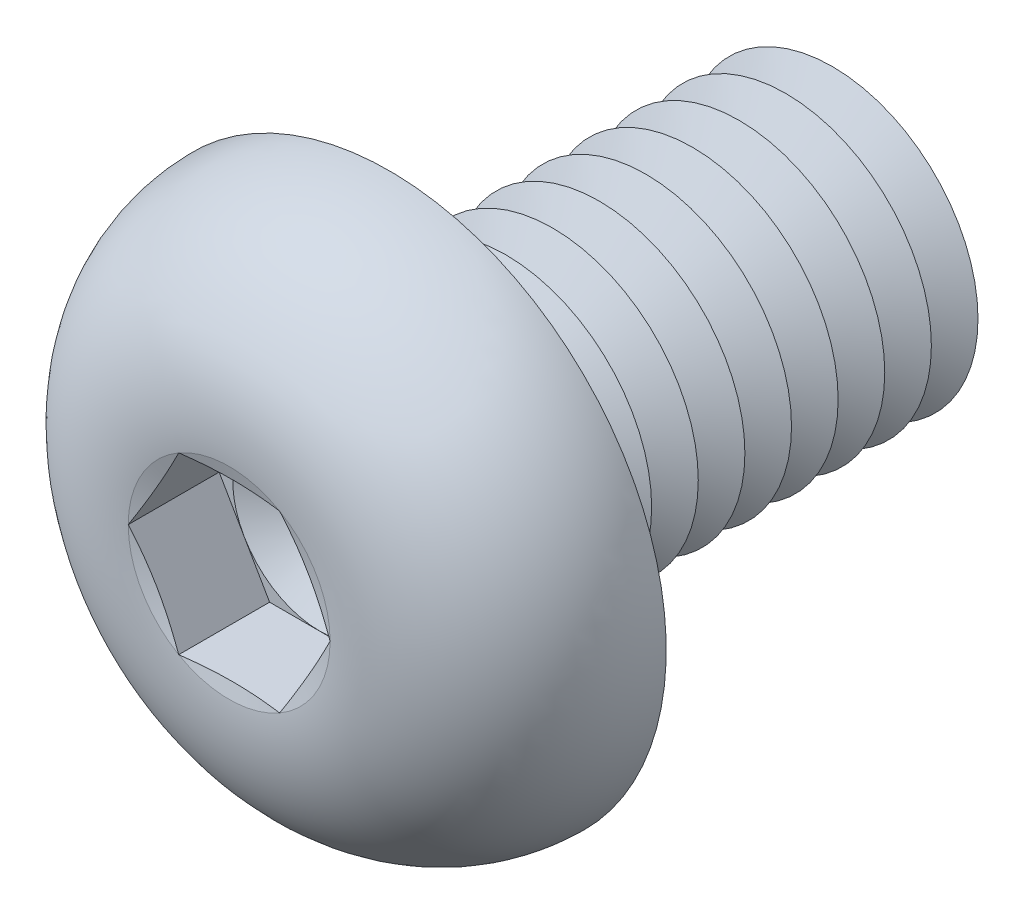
ISO-10303-21;
HEADER;
FILE_DESCRIPTION(('STEP AP214'),'2;1');
FILE_NAME('part.step','',(''),(''),'','','');
FILE_SCHEMA(('AUTOMOTIVE_DESIGN { 1 0 10303 214 1 1 1 1 }'));
ENDSEC;
DATA;
#1=APPLICATION_CONTEXT('core data for automotive mechanical design processes');
#2=APPLICATION_PROTOCOL_DEFINITION('international standard','automotive_design',2000,#1);
#3=PRODUCT_CONTEXT('',#1,'mechanical');
#4=PRODUCT('Part','Part','',(#3));
#5=PRODUCT_RELATED_PRODUCT_CATEGORY('part','',(#4));
#6=PRODUCT_DEFINITION_FORMATION('','',#4);
#7=PRODUCT_DEFINITION_CONTEXT('part definition',#1,'design');
#8=PRODUCT_DEFINITION('design','',#6,#7);
#9=PRODUCT_DEFINITION_SHAPE('','',#8);
#10=(LENGTH_UNIT() NAMED_UNIT(*) SI_UNIT(.MILLI.,.METRE.));
#11=(NAMED_UNIT(*) PLANE_ANGLE_UNIT() SI_UNIT($,.RADIAN.));
#12=(NAMED_UNIT(*) SI_UNIT($,.STERADIAN.) SOLID_ANGLE_UNIT());
#13=UNCERTAINTY_MEASURE_WITH_UNIT(LENGTH_MEASURE(1.E-05),#10,'distance_accuracy_value','');
#14=(GEOMETRIC_REPRESENTATION_CONTEXT(3) GLOBAL_UNCERTAINTY_ASSIGNED_CONTEXT((#13)) GLOBAL_UNIT_ASSIGNED_CONTEXT((#10,
#11,#12)) REPRESENTATION_CONTEXT('',''));
#15=CARTESIAN_POINT('',(0.,0.,0.));
#16=DIRECTION('',(0.,0.,1.));
#17=DIRECTION('',(1.,0.,0.));
#18=AXIS2_PLACEMENT_3D('',#15,#16,#17);
#19=CARTESIAN_POINT('',(0.,0.,1.19));
#20=DIRECTION('',(0.,0.,1.));
#21=DIRECTION('',(1.,0.,0.));
#22=AXIS2_PLACEMENT_3D('',#19,#20,#21);
#23=PLANE('',#22);
#24=CARTESIAN_POINT('',(0.,0.,1.19));
#25=DIRECTION('',(0.,0.,1.));
#26=DIRECTION('',(1.,0.,0.));
#27=AXIS2_PLACEMENT_3D('',#24,#25,#26);
#28=CIRCLE('',#27,1.49999930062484);
#29=CARTESIAN_POINT('',(1.2990375,0.749999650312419,1.19));
#30=VERTEX_POINT('',#29);
#31=CARTESIAN_POINT('',(0.,1.49999930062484,1.19));
#32=VERTEX_POINT('',#31);
#33=EDGE_CURVE('E118',#30,#32,#28,.T.);
#34=ORIENTED_EDGE('',*,*,#33,.F.);
#35=DIRECTION('',(-0.5,0.866025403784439,0.));
#36=VECTOR('',#35,1.);
#37=CARTESIAN_POINT('',(1.73205,0.,1.19));
#38=LINE('',#37,#36);
#39=CARTESIAN_POINT('',(0.866025,1.49999930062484,1.19));
#40=VERTEX_POINT('',#39);
#41=EDGE_CURVE('E125',#30,#40,#38,.T.);
#42=ORIENTED_EDGE('',*,*,#41,.T.);
#43=DIRECTION('',(-1.,0.,0.));
#44=VECTOR('',#43,1.);
#45=CARTESIAN_POINT('',(0.866025,1.49999930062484,1.19));
#46=LINE('',#45,#44);
#47=EDGE_CURVE('E136',#40,#32,#46,.T.);
#48=ORIENTED_EDGE('',*,*,#47,.T.);
#49=EDGE_LOOP('',(#34,#42,#48));
#50=FACE_BOUND('',#49,.T.);
#51=ADVANCED_FACE('F39',(#50),#23,.T.);
#52=CARTESIAN_POINT('',(0.,0.,1.19));
#53=DIRECTION('',(0.,0.,1.));
#54=DIRECTION('',(1.,0.,0.));
#55=AXIS2_PLACEMENT_3D('',#52,#53,#54);
#56=CIRCLE('',#55,1.49999930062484);
#57=CARTESIAN_POINT('',(-1.2990375,0.749999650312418,1.19));
#58=VERTEX_POINT('',#57);
#59=EDGE_CURVE('E11',#32,#58,#56,.T.);
#60=ORIENTED_EDGE('',*,*,#59,.F.);
#61=CARTESIAN_POINT('',(-0.866025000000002,1.49999930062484,1.19));
#62=VERTEX_POINT('',#61);
#63=EDGE_CURVE('E131',#32,#62,#46,.T.);
#64=ORIENTED_EDGE('',*,*,#63,.T.);
#65=DIRECTION('',(-0.5,-0.866025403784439,0.));
#66=VECTOR('',#65,1.);
#67=CARTESIAN_POINT('',(-0.866025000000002,1.49999930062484,1.19));
#68=LINE('',#67,#66);
#69=EDGE_CURVE('E134',#62,#58,#68,.T.);
#70=ORIENTED_EDGE('',*,*,#69,.T.);
#71=EDGE_LOOP('',(#60,#64,#70));
#72=FACE_BOUND('',#71,.T.);
#73=ADVANCED_FACE('F130',(#72),#23,.T.);
#74=CARTESIAN_POINT('',(-1.2990375,-0.749999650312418,1.19));
#75=VERTEX_POINT('',#74);
#76=EDGE_CURVE('E49',#58,#75,#56,.T.);
#77=ORIENTED_EDGE('',*,*,#76,.F.);
#78=CARTESIAN_POINT('',(-1.73205,0.,1.19));
#79=VERTEX_POINT('',#78);
#80=EDGE_CURVE('E143',#58,#79,#68,.T.);
#81=ORIENTED_EDGE('',*,*,#80,.T.);
#82=DIRECTION('',(0.5,-0.866025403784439,0.));
#83=VECTOR('',#82,1.);
#84=CARTESIAN_POINT('',(-1.73205,0.,1.19));
#85=LINE('',#84,#83);
#86=EDGE_CURVE('E152',#79,#75,#85,.T.);
#87=ORIENTED_EDGE('',*,*,#86,.T.);
#88=EDGE_LOOP('',(#77,#81,#87));
#89=FACE_BOUND('',#88,.T.);
#90=ADVANCED_FACE('F347',(#89),#23,.T.);
#91=CARTESIAN_POINT('',(0.,-1.49999930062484,1.19));
#92=VERTEX_POINT('',#91);
#93=EDGE_CURVE('E331',#75,#92,#56,.T.);
#94=ORIENTED_EDGE('',*,*,#93,.F.);
#95=CARTESIAN_POINT('',(-0.866025,-1.49999930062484,1.19));
#96=VERTEX_POINT('',#95);
#97=EDGE_CURVE('E151',#75,#96,#85,.T.);
#98=ORIENTED_EDGE('',*,*,#97,.T.);
#99=DIRECTION('',(1.,0.,0.));
#100=VECTOR('',#99,1.);
#101=CARTESIAN_POINT('',(-0.866025,-1.49999930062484,1.19));
#102=LINE('',#101,#100);
#103=EDGE_CURVE('E157',#96,#92,#102,.T.);
#104=ORIENTED_EDGE('',*,*,#103,.T.);
#105=EDGE_LOOP('',(#94,#98,#104));
#106=FACE_BOUND('',#105,.T.);
#107=ADVANCED_FACE('F340',(#106),#23,.T.);
#108=CARTESIAN_POINT('',(1.2990375,-0.749999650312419,1.19));
#109=VERTEX_POINT('',#108);
#110=EDGE_CURVE('E56',#92,#109,#56,.T.);
#111=ORIENTED_EDGE('',*,*,#110,.F.);
#112=CARTESIAN_POINT('',(0.866025,-1.49999930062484,1.19));
#113=VERTEX_POINT('',#112);
#114=EDGE_CURVE('E156',#92,#113,#102,.T.);
#115=ORIENTED_EDGE('',*,*,#114,.T.);
#116=DIRECTION('',(0.5,0.866025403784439,0.));
#117=VECTOR('',#116,1.);
#118=CARTESIAN_POINT('',(0.866025,-1.49999930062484,1.19));
#119=LINE('',#118,#117);
#120=EDGE_CURVE('E162',#113,#109,#119,.T.);
#121=ORIENTED_EDGE('',*,*,#120,.T.);
#122=EDGE_LOOP('',(#111,#115,#121));
#123=FACE_BOUND('',#122,.T.);
#124=ADVANCED_FACE('F430',(#123),#23,.T.);
#125=CARTESIAN_POINT('',(0.,0.,2.75));
#126=DIRECTION('',(0.,0.,1.));
#127=DIRECTION('',(1.,0.,0.));
#128=AXIS2_PLACEMENT_3D('',#125,#126,#127);
#129=CONICAL_SURFACE('',#128,1.73205,1.30899693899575);
#130=CARTESIAN_POINT('',(1.73216547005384,-0.000200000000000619,2.75003094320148));
#131=CARTESIAN_POINT('',(1.69619207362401,0.0621077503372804,2.74038633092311));
#132=CARTESIAN_POINT('',(1.66015343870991,0.124528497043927,2.73163050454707));
#133=CARTESIAN_POINT('',(1.58794885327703,0.249590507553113,2.71624720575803));
#134=CARTESIAN_POINT('',(1.5517828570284,0.312231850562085,2.70962059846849));
#135=CARTESIAN_POINT('',(1.47954289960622,0.437355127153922,2.69888271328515));
#136=CARTESIAN_POINT('',(1.4434694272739,0.499836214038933,2.69475862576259));
#137=CARTESIAN_POINT('',(1.37127646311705,0.624878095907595,2.68922863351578));
#138=CARTESIAN_POINT('',(1.33515698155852,0.687438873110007,2.68782220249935));
#139=CARTESIAN_POINT('',(1.26291801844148,0.812560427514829,2.68782220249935));
#140=CARTESIAN_POINT('',(1.22679853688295,0.87512120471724,2.68922863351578));
#141=CARTESIAN_POINT('',(1.1546055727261,1.0001630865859,2.69475862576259));
#142=CARTESIAN_POINT('',(1.11853210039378,1.06264417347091,2.69888271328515));
#143=CARTESIAN_POINT('',(1.0462921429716,1.18776745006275,2.70962059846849));
#144=CARTESIAN_POINT('',(1.01012614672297,1.25040879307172,2.71624720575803));
#145=CARTESIAN_POINT('',(0.937921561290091,1.37547080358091,2.73163050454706));
#146=CARTESIAN_POINT('',(0.901882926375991,1.43789155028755,2.74038633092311));
#147=CARTESIAN_POINT('',(0.865909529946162,1.50019930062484,2.75003094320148));
#148=B_SPLINE_CURVE_WITH_KNOTS('',3,(#130,#131,#132,#133,#134,#135,#136,#137,#138,#139,#140,
#141,#142,#143,#144,#145,#146,#147),.UNSPECIFIED.,.F.,.F.,(4,2,2,2,2,2,2,2,4),(0.,
0.217782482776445,0.435653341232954,0.652399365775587,0.869103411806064,1.08580745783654,
1.30255348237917,1.52042434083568,1.73820682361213),.UNSPECIFIED.);
#149=CARTESIAN_POINT('',(1.73205,0.,2.75));
#150=VERTEX_POINT('',#149);
#151=CARTESIAN_POINT('',(0.866025,1.49999930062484,2.75));
#152=VERTEX_POINT('',#151);
#153=EDGE_CURVE('E221',#150,#152,#148,.T.);
#154=ORIENTED_EDGE('',*,*,#153,.F.);
#155=CARTESIAN_POINT('',(0.,0.,2.75));
#156=DIRECTION('',(0.,0.,-1.));
#157=DIRECTION('',(-1.,0.,0.));
#158=AXIS2_PLACEMENT_3D('',#155,#156,#157);
#159=CIRCLE('',#158,1.73205);
#160=EDGE_CURVE('E378',#152,#150,#159,.T.);
#161=ORIENTED_EDGE('',*,*,#160,.F.);
#162=EDGE_LOOP('',(#154,#161));
#163=FACE_BOUND('',#162,.T.);
#164=ADVANCED_FACE('F396',(#163),#129,.F.);
#165=CARTESIAN_POINT('',(0.865909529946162,-1.50019930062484,2.75003094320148));
#166=CARTESIAN_POINT('',(0.901882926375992,-1.43789155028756,2.74038633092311));
#167=CARTESIAN_POINT('',(0.937921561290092,-1.37547080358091,2.73163050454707));
#168=CARTESIAN_POINT('',(1.01012614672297,-1.25040879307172,2.71624720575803));
#169=CARTESIAN_POINT('',(1.0462921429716,-1.18776745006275,2.70962059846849));
#170=CARTESIAN_POINT('',(1.11853210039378,-1.06264417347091,2.69888271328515));
#171=CARTESIAN_POINT('',(1.1546055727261,-1.0001630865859,2.69475862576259));
#172=CARTESIAN_POINT('',(1.22679853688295,-0.875121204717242,2.68922863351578));
#173=CARTESIAN_POINT('',(1.26291801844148,-0.81256042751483,2.68782220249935));
#174=CARTESIAN_POINT('',(1.33515698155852,-0.687438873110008,2.68782220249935));
#175=CARTESIAN_POINT('',(1.37127646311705,-0.624878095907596,2.68922863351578));
#176=CARTESIAN_POINT('',(1.4434694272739,-0.499836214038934,2.69475862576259));
#177=CARTESIAN_POINT('',(1.47954289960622,-0.437355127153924,2.69888271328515));
#178=CARTESIAN_POINT('',(1.5517828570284,-0.312231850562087,2.70962059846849));
#179=CARTESIAN_POINT('',(1.58794885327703,-0.249590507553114,2.71624720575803));
#180=CARTESIAN_POINT('',(1.66015343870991,-0.124528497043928,2.73163050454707));
#181=CARTESIAN_POINT('',(1.69619207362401,-0.0621077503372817,2.74038633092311));
#182=CARTESIAN_POINT('',(1.73216547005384,0.000199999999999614,2.75003094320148));
#183=B_SPLINE_CURVE_WITH_KNOTS('',3,(#165,#166,#167,#168,#169,#170,#171,#172,#173,#174,#175,
#176,#177,#178,#179,#180,#181,#182),.UNSPECIFIED.,.F.,.F.,(4,2,2,2,2,2,2,2,4),(0.,
0.217782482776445,0.435653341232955,0.652399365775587,0.869103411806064,1.08580745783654,
1.30255348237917,1.52042434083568,1.73820682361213),.UNSPECIFIED.);
#184=CARTESIAN_POINT('',(0.866025,-1.49999930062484,2.75));
#185=VERTEX_POINT('',#184);
#186=EDGE_CURVE('E230',#185,#150,#183,.T.);
#187=ORIENTED_EDGE('',*,*,#186,.F.);
#188=EDGE_CURVE('E380',#150,#185,#159,.T.);
#189=ORIENTED_EDGE('',*,*,#188,.F.);
#190=EDGE_LOOP('',(#187,#189));
#191=FACE_BOUND('',#190,.T.);
#192=ADVANCED_FACE('F398',(#191),#129,.F.);
#193=CARTESIAN_POINT('',(-2.61375031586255,-1.49999930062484,3.09338600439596));
#194=CARTESIAN_POINT('',(-2.48719895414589,-1.49999930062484,3.06401688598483));
#195=CARTESIAN_POINT('',(-2.36054180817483,-1.49999930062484,3.03507426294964));
#196=CARTESIAN_POINT('',(-2.10688190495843,-1.49999930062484,2.97862489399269));
#197=CARTESIAN_POINT('',(-1.97987908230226,-1.49999930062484,2.95111844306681));
#198=CARTESIAN_POINT('',(-1.72425281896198,-1.49999930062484,2.89788845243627));
#199=CARTESIAN_POINT('',(-1.59562534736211,-1.49999930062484,2.87218404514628));
#200=CARTESIAN_POINT('',(-1.33776732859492,-1.49999930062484,2.82387586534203));
#201=CARTESIAN_POINT('',(-1.20853672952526,-1.49999930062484,2.80127236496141));
#202=CARTESIAN_POINT('',(-0.952831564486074,-1.49999930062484,2.76126658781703));
#203=CARTESIAN_POINT('',(-0.826376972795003,-1.49999930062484,2.74374018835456));
#204=CARTESIAN_POINT('',(-0.572755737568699,-1.49999930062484,2.71502809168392));
#205=CARTESIAN_POINT('',(-0.445589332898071,-1.49999930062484,2.70384038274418));
#206=CARTESIAN_POINT('',(-0.191333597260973,-1.49999930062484,2.68972083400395));
#207=CARTESIAN_POINT('',(-0.0642464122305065,-1.49999930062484,2.68675270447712));
#208=CARTESIAN_POINT('',(0.189835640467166,-1.49999930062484,2.68959577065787));
#209=CARTESIAN_POINT('',(0.31683049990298,-1.49999930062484,2.69540767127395));
#210=CARTESIAN_POINT('',(0.53418249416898,-1.49999930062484,2.71190493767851));
#211=CARTESIAN_POINT('',(0.624691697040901,-1.49999930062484,2.72073513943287));
#212=CARTESIAN_POINT('',(0.805336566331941,-1.49999930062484,2.74156379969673));
#213=CARTESIAN_POINT('',(0.895472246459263,-1.49999930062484,2.75356214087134));
#214=CARTESIAN_POINT('',(1.0756572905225,-1.49999930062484,2.78006977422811));
#215=CARTESIAN_POINT('',(1.16570548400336,-1.49999930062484,2.7945868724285));
#216=CARTESIAN_POINT('',(1.3454787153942,-1.49999930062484,2.82550612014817));
#217=CARTESIAN_POINT('',(1.43520373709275,-1.49999930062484,2.8419083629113));
#218=CARTESIAN_POINT('',(1.61622412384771,-1.49999930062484,2.87648604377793));
#219=CARTESIAN_POINT('',(1.70751379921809,-1.49999930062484,2.89469103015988));
#220=CARTESIAN_POINT('',(1.88986344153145,-1.49999930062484,2.93221618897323));
#221=CARTESIAN_POINT('',(1.98092340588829,-1.49999930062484,2.95153637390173));
#222=CARTESIAN_POINT('',(2.16236354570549,-1.49999930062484,2.99091506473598));
#223=CARTESIAN_POINT('',(2.25274472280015,-1.49999930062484,3.01096897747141));
#224=CARTESIAN_POINT('',(2.43335289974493,-1.49999930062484,3.05173139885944));
#225=CARTESIAN_POINT('',(2.52357990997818,-1.49999930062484,3.07243986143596));
#226=CARTESIAN_POINT('',(2.61375031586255,-1.49999930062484,3.09338600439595));
#227=B_SPLINE_CURVE_WITH_KNOTS('',3,(#193,#194,#195,#196,#197,#198,#199,#200,#201,#202,#203,
#204,#205,#206,#207,#208,#209,#210,#211,#212,#213,#214,#215,#216,#217,#218,#219,#220,#221,#222,
#223,#224,#225,#226),.UNSPECIFIED.,.F.,.F.,(4,2,2,2,2,2,2,2,2,2,2,2,2,2,2,2,4),(0.,
0.389753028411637,0.779585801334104,1.17307326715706,1.5665952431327,1.94947555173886,
2.33223427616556,2.71330039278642,3.09439710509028,3.36715350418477,3.63989980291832,
3.91350699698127,4.18712773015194,4.4663802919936,4.74563598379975,5.02337106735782,
5.3010866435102),.UNSPECIFIED.);
#228=CARTESIAN_POINT('',(-0.866025,-1.49999930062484,2.75));
#229=VERTEX_POINT('',#228);
#230=EDGE_CURVE('E359',#229,#185,#227,.T.);
#231=ORIENTED_EDGE('',*,*,#230,.F.);
#232=EDGE_CURVE('E367',#185,#229,#159,.T.);
#233=ORIENTED_EDGE('',*,*,#232,.F.);
#234=EDGE_LOOP('',(#231,#233));
#235=FACE_BOUND('',#234,.T.);
#236=ADVANCED_FACE('F402',(#235),#129,.F.);
#237=CARTESIAN_POINT('',(-1.73216547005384,0.000200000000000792,2.75003094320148));
#238=CARTESIAN_POINT('',(-1.69619207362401,-0.0621077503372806,2.74038633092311));
#239=CARTESIAN_POINT('',(-1.66015343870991,-0.124528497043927,2.73163050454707));
#240=CARTESIAN_POINT('',(-1.58794885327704,-0.249590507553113,2.71624720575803));
#241=CARTESIAN_POINT('',(-1.55178285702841,-0.312231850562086,2.70962059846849));
#242=CARTESIAN_POINT('',(-1.47954289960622,-0.437355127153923,2.69888271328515));
#243=CARTESIAN_POINT('',(-1.4434694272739,-0.499836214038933,2.69475862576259));
#244=CARTESIAN_POINT('',(-1.37127646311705,-0.624878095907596,2.68922863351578));
#245=CARTESIAN_POINT('',(-1.33515698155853,-0.687438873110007,2.68782220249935));
#246=CARTESIAN_POINT('',(-1.26291801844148,-0.81256042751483,2.68782220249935));
#247=CARTESIAN_POINT('',(-1.22679853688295,-0.875121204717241,2.68922863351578));
#248=CARTESIAN_POINT('',(-1.1546055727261,-1.0001630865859,2.69475862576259));
#249=CARTESIAN_POINT('',(-1.11853210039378,-1.06264417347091,2.69888271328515));
#250=CARTESIAN_POINT('',(-1.0462921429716,-1.18776745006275,2.70962059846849));
#251=CARTESIAN_POINT('',(-1.01012614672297,-1.25040879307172,2.71624720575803));
#252=CARTESIAN_POINT('',(-0.937921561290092,-1.37547080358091,2.73163050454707));
#253=CARTESIAN_POINT('',(-0.901882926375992,-1.43789155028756,2.74038633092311));
#254=CARTESIAN_POINT('',(-0.865909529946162,-1.50019930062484,2.75003094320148));
#255=B_SPLINE_CURVE_WITH_KNOTS('',3,(#237,#238,#239,#240,#241,#242,#243,#244,#245,#246,#247,
#248,#249,#250,#251,#252,#253,#254),.UNSPECIFIED.,.F.,.F.,(4,2,2,2,2,2,2,2,4),(0.,
0.217782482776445,0.435653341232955,0.652399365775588,0.869103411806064,1.08580745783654,
1.30255348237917,1.52042434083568,1.73820682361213),.UNSPECIFIED.);
#256=CARTESIAN_POINT('',(-1.73205,0.,2.75));
#257=VERTEX_POINT('',#256);
#258=EDGE_CURVE('E352',#257,#229,#255,.T.);
#259=ORIENTED_EDGE('',*,*,#258,.F.);
#260=EDGE_CURVE('E315',#229,#257,#159,.T.);
#261=ORIENTED_EDGE('',*,*,#260,.F.);
#262=EDGE_LOOP('',(#259,#261));
#263=FACE_BOUND('',#262,.T.);
#264=ADVANCED_FACE('F356',(#263),#129,.F.);
#265=CARTESIAN_POINT('',(-0.865909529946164,1.50019930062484,2.75003094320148));
#266=CARTESIAN_POINT('',(-0.901882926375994,1.43789155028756,2.74038633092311));
#267=CARTESIAN_POINT('',(-0.937921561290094,1.37547080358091,2.73163050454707));
#268=CARTESIAN_POINT('',(-1.01012614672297,1.25040879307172,2.71624720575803));
#269=CARTESIAN_POINT('',(-1.0462921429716,1.18776745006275,2.70962059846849));
#270=CARTESIAN_POINT('',(-1.11853210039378,1.06264417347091,2.69888271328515));
#271=CARTESIAN_POINT('',(-1.1546055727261,1.0001630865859,2.69475862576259));
#272=CARTESIAN_POINT('',(-1.22679853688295,0.875121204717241,2.68922863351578));
#273=CARTESIAN_POINT('',(-1.26291801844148,0.81256042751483,2.68782220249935));
#274=CARTESIAN_POINT('',(-1.33515698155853,0.687438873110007,2.68782220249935));
#275=CARTESIAN_POINT('',(-1.37127646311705,0.624878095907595,2.68922863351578));
#276=CARTESIAN_POINT('',(-1.4434694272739,0.499836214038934,2.69475862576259));
#277=CARTESIAN_POINT('',(-1.47954289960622,0.437355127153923,2.69888271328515));
#278=CARTESIAN_POINT('',(-1.55178285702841,0.312231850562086,2.70962059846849));
#279=CARTESIAN_POINT('',(-1.58794885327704,0.249590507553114,2.71624720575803));
#280=CARTESIAN_POINT('',(-1.66015343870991,0.124528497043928,2.73163050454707));
#281=CARTESIAN_POINT('',(-1.69619207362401,0.0621077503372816,2.74038633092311));
#282=CARTESIAN_POINT('',(-1.73216547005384,-0.000199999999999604,2.75003094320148));
#283=B_SPLINE_CURVE_WITH_KNOTS('',3,(#265,#266,#267,#268,#269,#270,#271,#272,#273,#274,#275,
#276,#277,#278,#279,#280,#281,#282),.UNSPECIFIED.,.F.,.F.,(4,2,2,2,2,2,2,2,4),(0.,
0.217782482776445,0.435653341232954,0.652399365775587,0.869103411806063,1.08580745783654,
1.30255348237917,1.52042434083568,1.73820682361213),.UNSPECIFIED.);
#284=CARTESIAN_POINT('',(-0.866025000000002,1.49999930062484,2.75));
#285=VERTEX_POINT('',#284);
#286=EDGE_CURVE('E195',#285,#257,#283,.T.);
#287=ORIENTED_EDGE('',*,*,#286,.F.);
#288=EDGE_CURVE('E316',#257,#285,#159,.T.);
#289=ORIENTED_EDGE('',*,*,#288,.F.);
#290=EDGE_LOOP('',(#287,#289));
#291=FACE_BOUND('',#290,.T.);
#292=ADVANCED_FACE('F370',(#291),#129,.F.);
#293=CARTESIAN_POINT('',(0.,0.,-5.2));
#294=DIRECTION('',(0.,0.,1.));
#295=DIRECTION('',(1.,0.,0.));
#296=AXIS2_PLACEMENT_3D('',#293,#294,#295);
#297=CONICAL_SURFACE('',#296,2.5,1.0471975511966);
#298=CARTESIAN_POINT('',(0.,0.,-5.6));
#299=DIRECTION('',(0.,0.,1.));
#300=DIRECTION('',(1.,0.,0.));
#301=AXIS2_PLACEMENT_3D('',#298,#299,#300);
#302=CIRCLE('',#301,1.80717967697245);
#303=CARTESIAN_POINT('',(1.80717967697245,0.,-5.6));
#304=VERTEX_POINT('',#303);
#305=EDGE_CURVE('E288',#304,#304,#302,.T.);
#306=ORIENTED_EDGE('',*,*,#305,.T.);
#307=EDGE_LOOP('',(#306));
#308=FACE_BOUND('',#307,.T.);
#309=CARTESIAN_POINT('',(0.,0.,-5.2));
#310=DIRECTION('',(0.,0.,1.));
#311=DIRECTION('',(1.,0.,0.));
#312=AXIS2_PLACEMENT_3D('',#309,#310,#311);
#313=CIRCLE('',#312,2.5);
#314=CARTESIAN_POINT('',(2.5,0.,-5.2));
#315=VERTEX_POINT('',#314);
#316=EDGE_CURVE('E284',#315,#315,#313,.T.);
#317=ORIENTED_EDGE('',*,*,#316,.F.);
#318=EDGE_LOOP('',(#317));
#319=FACE_BOUND('',#318,.T.);
#320=ADVANCED_FACE('F482',(#308,#319),#297,.T.);
#321=CARTESIAN_POINT('',(0.,0.,-5.6));
#322=DIRECTION('',(0.,0.,-1.));
#323=DIRECTION('',(-1.,0.,0.));
#324=AXIS2_PLACEMENT_3D('',#321,#322,#323);
#325=CONICAL_SURFACE('',#324,1.80717967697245,1.0471975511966);
#326=CARTESIAN_POINT('',(0.,0.,-6.));
#327=DIRECTION('',(0.,0.,1.));
#328=DIRECTION('',(1.,0.,0.));
#329=AXIS2_PLACEMENT_3D('',#326,#327,#328);
#330=CIRCLE('',#329,2.5);
#331=CARTESIAN_POINT('',(2.5,0.,-6.));
#332=VERTEX_POINT('',#331);
#333=EDGE_CURVE('E292',#332,#332,#330,.T.);
#334=ORIENTED_EDGE('',*,*,#333,.T.);
#335=EDGE_LOOP('',(#334));
#336=FACE_BOUND('',#335,.T.);
#337=ORIENTED_EDGE('',*,*,#305,.F.);
#338=EDGE_LOOP('',(#337));
#339=FACE_BOUND('',#338,.T.);
#340=ADVANCED_FACE('F673',(#336,#339),#325,.T.);
#341=CARTESIAN_POINT('',(0.,2.5,-8.));
#342=DIRECTION('',(0.,0.,-1.));
#343=DIRECTION('',(-1.,0.,0.));
#344=AXIS2_PLACEMENT_3D('',#341,#342,#343);
#345=PLANE('',#344);
#346=CARTESIAN_POINT('',(0.,0.,-8.));
#347=DIRECTION('',(0.,0.,1.));
#348=DIRECTION('',(1.,0.,0.));
#349=AXIS2_PLACEMENT_3D('',#346,#347,#348);
#350=CIRCLE('',#349,1.80717967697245);
#351=CARTESIAN_POINT('',(1.80717967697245,0.,-8.));
#352=VERTEX_POINT('',#351);
#353=EDGE_CURVE('E312',#352,#352,#350,.T.);
#354=ORIENTED_EDGE('',*,*,#353,.F.);
#355=EDGE_LOOP('',(#354));
#356=FACE_BOUND('',#355,.T.);
#357=ADVANCED_FACE('F678',(#356),#345,.T.);
#358=CARTESIAN_POINT('',(0.,0.,-7.6));
#359=DIRECTION('',(0.,0.,1.));
#360=DIRECTION('',(1.,0.,0.));
#361=AXIS2_PLACEMENT_3D('',#358,#359,#360);
#362=CONICAL_SURFACE('',#361,2.5,1.0471975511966);
#363=ORIENTED_EDGE('',*,*,#353,.T.);
#364=EDGE_LOOP('',(#363));
#365=FACE_BOUND('',#364,.T.);
#366=CARTESIAN_POINT('',(0.,0.,-7.6));
#367=DIRECTION('',(0.,0.,1.));
#368=DIRECTION('',(1.,0.,0.));
#369=AXIS2_PLACEMENT_3D('',#366,#367,#368);
#370=CIRCLE('',#369,2.5);
#371=CARTESIAN_POINT('',(2.5,0.,-7.6));
#372=VERTEX_POINT('',#371);
#373=EDGE_CURVE('E308',#372,#372,#370,.T.);
#374=ORIENTED_EDGE('',*,*,#373,.F.);
#375=EDGE_LOOP('',(#374));
#376=FACE_BOUND('',#375,.T.);
#377=ADVANCED_FACE('F666',(#365,#376),#362,.T.);
#378=CARTESIAN_POINT('',(0.,0.,-7.2));
#379=DIRECTION('',(0.,0.,-1.));
#380=DIRECTION('',(-1.,0.,0.));
#381=AXIS2_PLACEMENT_3D('',#378,#379,#380);
#382=CONICAL_SURFACE('',#381,1.80717967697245,1.0471975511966);
#383=ORIENTED_EDGE('',*,*,#373,.T.);
#384=EDGE_LOOP('',(#383));
#385=FACE_BOUND('',#384,.T.);
#386=CARTESIAN_POINT('',(0.,0.,-7.2));
#387=DIRECTION('',(0.,0.,1.));
#388=DIRECTION('',(1.,0.,0.));
#389=AXIS2_PLACEMENT_3D('',#386,#387,#388);
#390=CIRCLE('',#389,1.80717967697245);
#391=CARTESIAN_POINT('',(1.80717967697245,0.,-7.2));
#392=VERTEX_POINT('',#391);
#393=EDGE_CURVE('E304',#392,#392,#390,.T.);
#394=ORIENTED_EDGE('',*,*,#393,.F.);
#395=EDGE_LOOP('',(#394));
#396=FACE_BOUND('',#395,.T.);
#397=ADVANCED_FACE('F656',(#385,#396),#382,.T.);
#398=CARTESIAN_POINT('',(0.,0.,-6.8));
#399=DIRECTION('',(0.,0.,1.));
#400=DIRECTION('',(1.,0.,0.));
#401=AXIS2_PLACEMENT_3D('',#398,#399,#400);
#402=CONICAL_SURFACE('',#401,2.5,1.0471975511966);
#403=ORIENTED_EDGE('',*,*,#393,.T.);
#404=EDGE_LOOP('',(#403));
#405=FACE_BOUND('',#404,.T.);
#406=CARTESIAN_POINT('',(0.,0.,-6.8));
#407=DIRECTION('',(0.,0.,1.));
#408=DIRECTION('',(1.,0.,0.));
#409=AXIS2_PLACEMENT_3D('',#406,#407,#408);
#410=CIRCLE('',#409,2.5);
#411=CARTESIAN_POINT('',(2.5,0.,-6.8));
#412=VERTEX_POINT('',#411);
#413=EDGE_CURVE('E300',#412,#412,#410,.T.);
#414=ORIENTED_EDGE('',*,*,#413,.F.);
#415=EDGE_LOOP('',(#414));
#416=FACE_BOUND('',#415,.T.);
#417=ADVANCED_FACE('F646',(#405,#416),#402,.T.);
#418=CARTESIAN_POINT('',(0.,0.,-6.4));
#419=DIRECTION('',(0.,0.,-1.));
#420=DIRECTION('',(-1.,0.,0.));
#421=AXIS2_PLACEMENT_3D('',#418,#419,#420);
#422=CONICAL_SURFACE('',#421,1.80717967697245,1.0471975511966);
#423=ORIENTED_EDGE('',*,*,#413,.T.);
#424=EDGE_LOOP('',(#423));
#425=FACE_BOUND('',#424,.T.);
#426=CARTESIAN_POINT('',(0.,0.,-6.4));
#427=DIRECTION('',(0.,0.,1.));
#428=DIRECTION('',(1.,0.,0.));
#429=AXIS2_PLACEMENT_3D('',#426,#427,#428);
#430=CIRCLE('',#429,1.80717967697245);
#431=CARTESIAN_POINT('',(1.80717967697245,0.,-6.4));
#432=VERTEX_POINT('',#431);
#433=EDGE_CURVE('E296',#432,#432,#430,.T.);
#434=ORIENTED_EDGE('',*,*,#433,.F.);
#435=EDGE_LOOP('',(#434));
#436=FACE_BOUND('',#435,.T.);
#437=ADVANCED_FACE('F636',(#425,#436),#422,.T.);
#438=CARTESIAN_POINT('',(0.,0.,-6.));
#439=DIRECTION('',(0.,0.,1.));
#440=DIRECTION('',(1.,0.,0.));
#441=AXIS2_PLACEMENT_3D('',#438,#439,#440);
#442=CONICAL_SURFACE('',#441,2.5,1.0471975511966);
#443=ORIENTED_EDGE('',*,*,#433,.T.);
#444=EDGE_LOOP('',(#443));
#445=FACE_BOUND('',#444,.T.);
#446=ORIENTED_EDGE('',*,*,#333,.F.);
#447=EDGE_LOOP('',(#446));
#448=FACE_BOUND('',#447,.T.);
#449=ADVANCED_FACE('F626',(#445,#448),#442,.T.);
#450=CARTESIAN_POINT('',(0.,0.,-4.4));
#451=DIRECTION('',(0.,0.,1.));
#452=DIRECTION('',(1.,0.,0.));
#453=AXIS2_PLACEMENT_3D('',#450,#451,#452);
#454=CONICAL_SURFACE('',#453,2.5,1.0471975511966);
#455=CARTESIAN_POINT('',(0.,0.,-4.8));
#456=DIRECTION('',(0.,0.,1.));
#457=DIRECTION('',(1.,0.,0.));
#458=AXIS2_PLACEMENT_3D('',#455,#456,#457);
#459=CIRCLE('',#458,1.80717967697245);
#460=CARTESIAN_POINT('',(1.80717967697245,0.,-4.8));
#461=VERTEX_POINT('',#460);
#462=EDGE_CURVE('E280',#461,#461,#459,.T.);
#463=ORIENTED_EDGE('',*,*,#462,.T.);
#464=EDGE_LOOP('',(#463));
#465=FACE_BOUND('',#464,.T.);
#466=CARTESIAN_POINT('',(0.,0.,-4.4));
#467=DIRECTION('',(0.,0.,1.));
#468=DIRECTION('',(1.,0.,0.));
#469=AXIS2_PLACEMENT_3D('',#466,#467,#468);
#470=CIRCLE('',#469,2.5);
#471=CARTESIAN_POINT('',(2.5,0.,-4.4));
#472=VERTEX_POINT('',#471);
#473=EDGE_CURVE('E276',#472,#472,#470,.T.);
#474=ORIENTED_EDGE('',*,*,#473,.F.);
#475=EDGE_LOOP('',(#474));
#476=FACE_BOUND('',#475,.T.);
#477=ADVANCED_FACE('F616',(#465,#476),#454,.T.);
#478=CARTESIAN_POINT('',(0.,0.,-4.8));
#479=DIRECTION('',(0.,0.,-1.));
#480=DIRECTION('',(-1.,0.,0.));
#481=AXIS2_PLACEMENT_3D('',#478,#479,#480);
#482=CONICAL_SURFACE('',#481,1.80717967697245,1.0471975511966);
#483=ORIENTED_EDGE('',*,*,#316,.T.);
#484=EDGE_LOOP('',(#483));
#485=FACE_BOUND('',#484,.T.);
#486=ORIENTED_EDGE('',*,*,#462,.F.);
#487=EDGE_LOOP('',(#486));
#488=FACE_BOUND('',#487,.T.);
#489=ADVANCED_FACE('F606',(#485,#488),#482,.T.);
#490=CARTESIAN_POINT('',(0.,0.,-3.6));
#491=DIRECTION('',(0.,0.,1.));
#492=DIRECTION('',(1.,0.,0.));
#493=AXIS2_PLACEMENT_3D('',#490,#491,#492);
#494=CONICAL_SURFACE('',#493,2.5,1.0471975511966);
#495=CARTESIAN_POINT('',(0.,0.,-4.));
#496=DIRECTION('',(0.,0.,1.));
#497=DIRECTION('',(1.,0.,0.));
#498=AXIS2_PLACEMENT_3D('',#495,#496,#497);
#499=CIRCLE('',#498,1.80717967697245);
#500=CARTESIAN_POINT('',(1.80717967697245,0.,-4.));
#501=VERTEX_POINT('',#500);
#502=EDGE_CURVE('E272',#501,#501,#499,.T.);
#503=ORIENTED_EDGE('',*,*,#502,.T.);
#504=EDGE_LOOP('',(#503));
#505=FACE_BOUND('',#504,.T.);
#506=CARTESIAN_POINT('',(0.,0.,-3.6));
#507=DIRECTION('',(0.,0.,1.));
#508=DIRECTION('',(1.,0.,0.));
#509=AXIS2_PLACEMENT_3D('',#506,#507,#508);
#510=CIRCLE('',#509,2.5);
#511=CARTESIAN_POINT('',(2.5,0.,-3.6));
#512=VERTEX_POINT('',#511);
#513=EDGE_CURVE('E268',#512,#512,#510,.T.);
#514=ORIENTED_EDGE('',*,*,#513,.F.);
#515=EDGE_LOOP('',(#514));
#516=FACE_BOUND('',#515,.T.);
#517=ADVANCED_FACE('F596',(#505,#516),#494,.T.);
#518=CARTESIAN_POINT('',(0.,0.,-4.));
#519=DIRECTION('',(0.,0.,-1.));
#520=DIRECTION('',(-1.,0.,0.));
#521=AXIS2_PLACEMENT_3D('',#518,#519,#520);
#522=CONICAL_SURFACE('',#521,1.80717967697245,1.0471975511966);
#523=ORIENTED_EDGE('',*,*,#473,.T.);
#524=EDGE_LOOP('',(#523));
#525=FACE_BOUND('',#524,.T.);
#526=ORIENTED_EDGE('',*,*,#502,.F.);
#527=EDGE_LOOP('',(#526));
#528=FACE_BOUND('',#527,.T.);
#529=ADVANCED_FACE('F586',(#525,#528),#522,.T.);
#530=CARTESIAN_POINT('',(0.,0.,-2.8));
#531=DIRECTION('',(0.,0.,1.));
#532=DIRECTION('',(1.,0.,0.));
#533=AXIS2_PLACEMENT_3D('',#530,#531,#532);
#534=CONICAL_SURFACE('',#533,2.5,1.0471975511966);
#535=CARTESIAN_POINT('',(0.,0.,-3.2));
#536=DIRECTION('',(0.,0.,1.));
#537=DIRECTION('',(1.,0.,0.));
#538=AXIS2_PLACEMENT_3D('',#535,#536,#537);
#539=CIRCLE('',#538,1.80717967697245);
#540=CARTESIAN_POINT('',(1.80717967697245,0.,-3.2));
#541=VERTEX_POINT('',#540);
#542=EDGE_CURVE('E264',#541,#541,#539,.T.);
#543=ORIENTED_EDGE('',*,*,#542,.T.);
#544=EDGE_LOOP('',(#543));
#545=FACE_BOUND('',#544,.T.);
#546=CARTESIAN_POINT('',(0.,0.,-2.8));
#547=DIRECTION('',(0.,0.,1.));
#548=DIRECTION('',(1.,0.,0.));
#549=AXIS2_PLACEMENT_3D('',#546,#547,#548);
#550=CIRCLE('',#549,2.5);
#551=CARTESIAN_POINT('',(2.5,0.,-2.8));
#552=VERTEX_POINT('',#551);
#553=EDGE_CURVE('E260',#552,#552,#550,.T.);
#554=ORIENTED_EDGE('',*,*,#553,.F.);
#555=EDGE_LOOP('',(#554));
#556=FACE_BOUND('',#555,.T.);
#557=ADVANCED_FACE('F576',(#545,#556),#534,.T.);
#558=CARTESIAN_POINT('',(0.,0.,-3.2));
#559=DIRECTION('',(0.,0.,-1.));
#560=DIRECTION('',(-1.,0.,0.));
#561=AXIS2_PLACEMENT_3D('',#558,#559,#560);
#562=CONICAL_SURFACE('',#561,1.80717967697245,1.0471975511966);
#563=ORIENTED_EDGE('',*,*,#513,.T.);
#564=EDGE_LOOP('',(#563));
#565=FACE_BOUND('',#564,.T.);
#566=ORIENTED_EDGE('',*,*,#542,.F.);
#567=EDGE_LOOP('',(#566));
#568=FACE_BOUND('',#567,.T.);
#569=ADVANCED_FACE('F566',(#565,#568),#562,.T.);
#570=CARTESIAN_POINT('',(0.,0.,-2.));
#571=DIRECTION('',(0.,0.,1.));
#572=DIRECTION('',(1.,0.,0.));
#573=AXIS2_PLACEMENT_3D('',#570,#571,#572);
#574=CONICAL_SURFACE('',#573,2.5,1.0471975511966);
#575=CARTESIAN_POINT('',(0.,0.,-2.4));
#576=DIRECTION('',(0.,0.,1.));
#577=DIRECTION('',(1.,0.,0.));
#578=AXIS2_PLACEMENT_3D('',#575,#576,#577);
#579=CIRCLE('',#578,1.80717967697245);
#580=CARTESIAN_POINT('',(1.80717967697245,0.,-2.4));
#581=VERTEX_POINT('',#580);
#582=EDGE_CURVE('E256',#581,#581,#579,.T.);
#583=ORIENTED_EDGE('',*,*,#582,.T.);
#584=EDGE_LOOP('',(#583));
#585=FACE_BOUND('',#584,.T.);
#586=CARTESIAN_POINT('',(0.,0.,-2.));
#587=DIRECTION('',(0.,0.,1.));
#588=DIRECTION('',(1.,0.,0.));
#589=AXIS2_PLACEMENT_3D('',#586,#587,#588);
#590=CIRCLE('',#589,2.5);
#591=CARTESIAN_POINT('',(2.5,0.,-2.));
#592=VERTEX_POINT('',#591);
#593=EDGE_CURVE('E252',#592,#592,#590,.T.);
#594=ORIENTED_EDGE('',*,*,#593,.F.);
#595=EDGE_LOOP('',(#594));
#596=FACE_BOUND('',#595,.T.);
#597=ADVANCED_FACE('F556',(#585,#596),#574,.T.);
#598=CARTESIAN_POINT('',(0.,0.,-2.4));
#599=DIRECTION('',(0.,0.,-1.));
#600=DIRECTION('',(-1.,0.,0.));
#601=AXIS2_PLACEMENT_3D('',#598,#599,#600);
#602=CONICAL_SURFACE('',#601,1.80717967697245,1.0471975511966);
#603=ORIENTED_EDGE('',*,*,#553,.T.);
#604=EDGE_LOOP('',(#603));
#605=FACE_BOUND('',#604,.T.);
#606=ORIENTED_EDGE('',*,*,#582,.F.);
#607=EDGE_LOOP('',(#606));
#608=FACE_BOUND('',#607,.T.);
#609=ADVANCED_FACE('F546',(#605,#608),#602,.T.);
#610=CARTESIAN_POINT('',(0.,0.,-1.2));
#611=DIRECTION('',(0.,0.,1.));
#612=DIRECTION('',(1.,0.,0.));
#613=AXIS2_PLACEMENT_3D('',#610,#611,#612);
#614=CONICAL_SURFACE('',#613,2.5,1.0471975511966);
#615=CARTESIAN_POINT('',(0.,0.,-1.6));
#616=DIRECTION('',(0.,0.,1.));
#617=DIRECTION('',(1.,0.,0.));
#618=AXIS2_PLACEMENT_3D('',#615,#616,#617);
#619=CIRCLE('',#618,1.80717967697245);
#620=CARTESIAN_POINT('',(1.80717967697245,0.,-1.6));
#621=VERTEX_POINT('',#620);
#622=EDGE_CURVE('E248',#621,#621,#619,.T.);
#623=ORIENTED_EDGE('',*,*,#622,.T.);
#624=EDGE_LOOP('',(#623));
#625=FACE_BOUND('',#624,.T.);
#626=CARTESIAN_POINT('',(0.,0.,-1.2));
#627=DIRECTION('',(0.,0.,1.));
#628=DIRECTION('',(1.,0.,0.));
#629=AXIS2_PLACEMENT_3D('',#626,#627,#628);
#630=CIRCLE('',#629,2.5);
#631=CARTESIAN_POINT('',(2.5,0.,-1.2));
#632=VERTEX_POINT('',#631);
#633=EDGE_CURVE('E240',#632,#632,#630,.T.);
#634=ORIENTED_EDGE('',*,*,#633,.F.);
#635=EDGE_LOOP('',(#634));
#636=FACE_BOUND('',#635,.T.);
#637=ADVANCED_FACE('F536',(#625,#636),#614,.T.);
#638=CARTESIAN_POINT('',(0.,0.,-1.6));
#639=DIRECTION('',(0.,0.,-1.));
#640=DIRECTION('',(-1.,0.,0.));
#641=AXIS2_PLACEMENT_3D('',#638,#639,#640);
#642=CONICAL_SURFACE('',#641,1.80717967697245,1.0471975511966);
#643=ORIENTED_EDGE('',*,*,#593,.T.);
#644=EDGE_LOOP('',(#643));
#645=FACE_BOUND('',#644,.T.);
#646=ORIENTED_EDGE('',*,*,#622,.F.);
#647=EDGE_LOOP('',(#646));
#648=FACE_BOUND('',#647,.T.);
#649=ADVANCED_FACE('F527',(#645,#648),#642,.T.);
#650=CARTESIAN_POINT('',(0.,0.,-0.399999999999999));
#651=DIRECTION('',(0.,0.,1.));
#652=DIRECTION('',(1.,0.,0.));
#653=AXIS2_PLACEMENT_3D('',#650,#651,#652);
#654=CONICAL_SURFACE('',#653,2.5,1.0471975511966);
#655=CARTESIAN_POINT('',(0.,0.,-0.799999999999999));
#656=DIRECTION('',(0.,0.,1.));
#657=DIRECTION('',(1.,0.,0.));
#658=AXIS2_PLACEMENT_3D('',#655,#656,#657);
#659=CIRCLE('',#658,1.80717967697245);
#660=CARTESIAN_POINT('',(1.80717967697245,0.,-0.799999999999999));
#661=VERTEX_POINT('',#660);
#662=EDGE_CURVE('E229',#661,#661,#659,.T.);
#663=ORIENTED_EDGE('',*,*,#662,.T.);
#664=EDGE_LOOP('',(#663));
#665=FACE_BOUND('',#664,.T.);
#666=CARTESIAN_POINT('',(0.,0.,-0.399999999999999));
#667=DIRECTION('',(0.,0.,1.));
#668=DIRECTION('',(1.,0.,0.));
#669=AXIS2_PLACEMENT_3D('',#666,#667,#668);
#670=CIRCLE('',#669,2.5);
#671=CARTESIAN_POINT('',(2.5,0.,-0.399999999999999));
#672=VERTEX_POINT('',#671);
#673=EDGE_CURVE('E244',#672,#672,#670,.T.);
#674=ORIENTED_EDGE('',*,*,#673,.F.);
#675=EDGE_LOOP('',(#674));
#676=FACE_BOUND('',#675,.T.);
#677=ADVANCED_FACE('F518',(#665,#676),#654,.T.);
#678=CARTESIAN_POINT('',(0.,0.,-0.799999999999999));
#679=DIRECTION('',(0.,0.,-1.));
#680=DIRECTION('',(-1.,0.,0.));
#681=AXIS2_PLACEMENT_3D('',#678,#679,#680);
#682=CONICAL_SURFACE('',#681,1.80717967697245,1.0471975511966);
#683=ORIENTED_EDGE('',*,*,#633,.T.);
#684=EDGE_LOOP('',(#683));
#685=FACE_BOUND('',#684,.T.);
#686=ORIENTED_EDGE('',*,*,#662,.F.);
#687=EDGE_LOOP('',(#686));
#688=FACE_BOUND('',#687,.T.);
#689=ADVANCED_FACE('F218',(#685,#688),#682,.T.);
#690=CARTESIAN_POINT('',(2.61375031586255,1.49999930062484,3.09338600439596));
#691=CARTESIAN_POINT('',(2.48719895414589,1.49999930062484,3.06401688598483));
#692=CARTESIAN_POINT('',(2.36054180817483,1.49999930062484,3.03507426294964));
#693=CARTESIAN_POINT('',(2.10688190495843,1.49999930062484,2.97862489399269));
#694=CARTESIAN_POINT('',(1.97987908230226,1.49999930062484,2.95111844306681));
#695=CARTESIAN_POINT('',(1.72425281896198,1.49999930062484,2.89788845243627));
#696=CARTESIAN_POINT('',(1.59562534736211,1.49999930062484,2.87218404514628));
#697=CARTESIAN_POINT('',(1.33776732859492,1.49999930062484,2.82387586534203));
#698=CARTESIAN_POINT('',(1.20853672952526,1.49999930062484,2.80127236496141));
#699=CARTESIAN_POINT('',(0.952831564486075,1.49999930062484,2.76126658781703));
#700=CARTESIAN_POINT('',(0.826376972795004,1.49999930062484,2.74374018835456));
#701=CARTESIAN_POINT('',(0.572755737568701,1.49999930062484,2.71502809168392));
#702=CARTESIAN_POINT('',(0.445589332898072,1.49999930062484,2.70384038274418));
#703=CARTESIAN_POINT('',(0.191333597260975,1.49999930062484,2.68972083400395));
#704=CARTESIAN_POINT('',(0.064246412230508,1.49999930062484,2.68675270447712));
#705=CARTESIAN_POINT('',(-0.189835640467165,1.49999930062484,2.68959577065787));
#706=CARTESIAN_POINT('',(-0.316830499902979,1.49999930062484,2.69540767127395));
#707=CARTESIAN_POINT('',(-0.534182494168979,1.49999930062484,2.71190493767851));
#708=CARTESIAN_POINT('',(-0.6246916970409,1.49999930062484,2.72073513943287));
#709=CARTESIAN_POINT('',(-0.80533656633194,1.49999930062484,2.74156379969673));
#710=CARTESIAN_POINT('',(-0.895472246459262,1.49999930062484,2.75356214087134));
#711=CARTESIAN_POINT('',(-1.0756572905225,1.49999930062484,2.78006977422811));
#712=CARTESIAN_POINT('',(-1.16570548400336,1.49999930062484,2.7945868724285));
#713=CARTESIAN_POINT('',(-1.3454787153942,1.49999930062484,2.82550612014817));
#714=CARTESIAN_POINT('',(-1.43520373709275,1.49999930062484,2.8419083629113));
#715=CARTESIAN_POINT('',(-1.61622412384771,1.49999930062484,2.87648604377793));
#716=CARTESIAN_POINT('',(-1.70751379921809,1.49999930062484,2.89469103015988));
#717=CARTESIAN_POINT('',(-1.88986344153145,1.49999930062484,2.93221618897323));
#718=CARTESIAN_POINT('',(-1.98092340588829,1.49999930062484,2.95153637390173));
#719=CARTESIAN_POINT('',(-2.16236354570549,1.49999930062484,2.99091506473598));
#720=CARTESIAN_POINT('',(-2.25274472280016,1.49999930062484,3.01096897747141));
#721=CARTESIAN_POINT('',(-2.43335289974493,1.49999930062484,3.05173139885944));
#722=CARTESIAN_POINT('',(-2.52357990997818,1.49999930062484,3.07243986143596));
#723=CARTESIAN_POINT('',(-2.61375031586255,1.49999930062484,3.09338600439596));
#724=B_SPLINE_CURVE_WITH_KNOTS('',3,(#690,#691,#692,#693,#694,#695,#696,#697,#698,#699,#700,
#701,#702,#703,#704,#705,#706,#707,#708,#709,#710,#711,#712,#713,#714,#715,#716,#717,#718,#719,
#720,#721,#722,#723),.UNSPECIFIED.,.F.,.F.,(4,2,2,2,2,2,2,2,2,2,2,2,2,2,2,2,4),(0.,
0.389753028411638,0.779585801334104,1.17307326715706,1.5665952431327,1.94947555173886,
2.33223427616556,2.71330039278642,3.09439710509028,3.36715350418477,3.63989980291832,
3.91350699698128,4.18712773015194,4.4663802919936,4.74563598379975,5.02337106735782,
5.3010866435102),.UNSPECIFIED.);
#725=EDGE_CURVE('E170',#152,#285,#724,.T.);
#726=ORIENTED_EDGE('',*,*,#725,.F.);
#727=EDGE_CURVE('E321',#285,#152,#159,.T.);
#728=ORIENTED_EDGE('',*,*,#727,.F.);
#729=EDGE_LOOP('',(#726,#728));
#730=FACE_BOUND('',#729,.T.);
#731=ADVANCED_FACE('F202',(#730),#129,.F.);
#732=CARTESIAN_POINT('',(0.,0.,0.));
#733=DIRECTION('',(0.,0.,-1.));
#734=DIRECTION('',(-1.,0.,0.));
#735=AXIS2_PLACEMENT_3D('',#732,#733,#734);
#736=DEGENERATE_TOROIDAL_SURFACE('',#735,1.98810497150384,2.76189502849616,.T.);
#737=ORIENTED_EDGE('',*,*,#288,.T.);
#738=ORIENTED_EDGE('',*,*,#727,.T.);
#739=ORIENTED_EDGE('',*,*,#160,.T.);
#740=ORIENTED_EDGE('',*,*,#188,.T.);
#741=ORIENTED_EDGE('',*,*,#232,.T.);
#742=ORIENTED_EDGE('',*,*,#260,.T.);
#743=EDGE_LOOP('',(#737,#738,#739,#740,#741,#742));
#744=FACE_BOUND('',#743,.T.);
#745=CARTESIAN_POINT('',(0.,0.,0.));
#746=DIRECTION('',(0.,0.,-1.));
#747=DIRECTION('',(-1.,0.,0.));
#748=AXIS2_PLACEMENT_3D('',#745,#746,#747);
#749=CIRCLE('',#748,4.75);
#750=CARTESIAN_POINT('',(-4.75,0.,0.));
#751=VERTEX_POINT('',#750);
#752=EDGE_CURVE('E320',#751,#751,#749,.T.);
#753=ORIENTED_EDGE('',*,*,#752,.F.);
#754=EDGE_LOOP('',(#753));
#755=FACE_BOUND('',#754,.T.);
#756=ADVANCED_FACE('F362',(#744,#755),#736,.T.);
#757=CARTESIAN_POINT('',(0.,2.5,0.));
#758=DIRECTION('',(0.,0.,-1.));
#759=DIRECTION('',(-1.,0.,0.));
#760=AXIS2_PLACEMENT_3D('',#757,#758,#759);
#761=PLANE('',#760);
#762=CARTESIAN_POINT('',(0.,0.,0.));
#763=DIRECTION('',(0.,0.,-1.));
#764=DIRECTION('',(-1.,0.,0.));
#765=AXIS2_PLACEMENT_3D('',#762,#763,#764);
#766=CIRCLE('',#765,2.9);
#767=CARTESIAN_POINT('',(-2.9,0.,0.));
#768=VERTEX_POINT('',#767);
#769=EDGE_CURVE('E324',#768,#768,#766,.F.);
#770=ORIENTED_EDGE('',*,*,#769,.T.);
#771=EDGE_LOOP('',(#770));
#772=FACE_BOUND('',#771,.T.);
#773=ORIENTED_EDGE('',*,*,#752,.T.);
#774=EDGE_LOOP('',(#773));
#775=FACE_BOUND('',#774,.T.);
#776=ADVANCED_FACE('F463',(#772,#775),#761,.T.);
#777=CARTESIAN_POINT('',(0.,0.,-0.399999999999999));
#778=DIRECTION('',(0.,0.,-1.));
#779=DIRECTION('',(-1.,0.,0.));
#780=AXIS2_PLACEMENT_3D('',#777,#778,#779);
#781=TOROIDAL_SURFACE('',#780,2.9,0.4);
#782=ORIENTED_EDGE('',*,*,#769,.F.);
#783=EDGE_LOOP('',(#782));
#784=FACE_BOUND('',#783,.T.);
#785=ORIENTED_EDGE('',*,*,#673,.T.);
#786=EDGE_LOOP('',(#785));
#787=FACE_BOUND('',#786,.T.);
#788=ADVANCED_FACE('F41',(#784,#787),#781,.F.);
#789=CARTESIAN_POINT('',(1.73205,0.,1.19));
#790=DIRECTION('',(0.866025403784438,0.5,0.));
#791=DIRECTION('',(-0.5,0.866025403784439,0.));
#792=AXIS2_PLACEMENT_3D('',#789,#790,#791);
#793=PLANE('',#792);
#794=ORIENTED_EDGE('',*,*,#153,.T.);
#795=DIRECTION('',(0.,0.,1.));
#796=VECTOR('',#795,1.);
#797=CARTESIAN_POINT('',(0.866025,1.49999930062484,1.19));
#798=LINE('',#797,#796);
#799=EDGE_CURVE('E64',#40,#152,#798,.T.);
#800=ORIENTED_EDGE('',*,*,#799,.F.);
#801=ORIENTED_EDGE('',*,*,#41,.F.);
#802=CARTESIAN_POINT('',(1.73205,0.,1.19));
#803=VERTEX_POINT('',#802);
#804=EDGE_CURVE('E140',#803,#30,#38,.T.);
#805=ORIENTED_EDGE('',*,*,#804,.F.);
#806=DIRECTION('',(0.,0.,1.));
#807=VECTOR('',#806,1.);
#808=CARTESIAN_POINT('',(1.73205,0.,1.19));
#809=LINE('',#808,#807);
#810=EDGE_CURVE('E166',#803,#150,#809,.T.);
#811=ORIENTED_EDGE('',*,*,#810,.T.);
#812=EDGE_LOOP('',(#794,#800,#801,#805,#811));
#813=FACE_BOUND('',#812,.T.);
#814=ADVANCED_FACE('F212',(#813),#793,.F.);
#815=CARTESIAN_POINT('',(0.866025,-1.49999930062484,1.19));
#816=DIRECTION('',(0.866025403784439,-0.5,0.));
#817=DIRECTION('',(0.5,0.866025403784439,0.));
#818=AXIS2_PLACEMENT_3D('',#815,#816,#817);
#819=PLANE('',#818);
#820=ORIENTED_EDGE('',*,*,#186,.T.);
#821=ORIENTED_EDGE('',*,*,#810,.F.);
#822=EDGE_CURVE('E161',#109,#803,#119,.T.);
#823=ORIENTED_EDGE('',*,*,#822,.F.);
#824=ORIENTED_EDGE('',*,*,#120,.F.);
#825=DIRECTION('',(0.,0.,1.));
#826=VECTOR('',#825,1.);
#827=CARTESIAN_POINT('',(0.866025,-1.49999930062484,1.19));
#828=LINE('',#827,#826);
#829=EDGE_CURVE('E171',#113,#185,#828,.T.);
#830=ORIENTED_EDGE('',*,*,#829,.T.);
#831=EDGE_LOOP('',(#820,#821,#823,#824,#830));
#832=FACE_BOUND('',#831,.T.);
#833=ADVANCED_FACE('F216',(#832),#819,.F.);
#834=CARTESIAN_POINT('',(-0.866025,-1.49999930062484,1.19));
#835=DIRECTION('',(0.,-1.,0.));
#836=DIRECTION('',(0.,0.,-1.));
#837=AXIS2_PLACEMENT_3D('',#834,#835,#836);
#838=PLANE('',#837);
#839=ORIENTED_EDGE('',*,*,#230,.T.);
#840=ORIENTED_EDGE('',*,*,#829,.F.);
#841=ORIENTED_EDGE('',*,*,#114,.F.);
#842=ORIENTED_EDGE('',*,*,#103,.F.);
#843=DIRECTION('',(0.,0.,1.));
#844=VECTOR('',#843,1.);
#845=CARTESIAN_POINT('',(-0.866025,-1.49999930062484,1.19));
#846=LINE('',#845,#844);
#847=EDGE_CURVE('E175',#96,#229,#846,.T.);
#848=ORIENTED_EDGE('',*,*,#847,.T.);
#849=EDGE_LOOP('',(#839,#840,#841,#842,#848));
#850=FACE_BOUND('',#849,.T.);
#851=ADVANCED_FACE('F415',(#850),#838,.F.);
#852=CARTESIAN_POINT('',(-1.73205,0.,1.19));
#853=DIRECTION('',(-0.866025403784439,-0.5,0.));
#854=DIRECTION('',(0.5,-0.866025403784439,0.));
#855=AXIS2_PLACEMENT_3D('',#852,#853,#854);
#856=PLANE('',#855);
#857=ORIENTED_EDGE('',*,*,#258,.T.);
#858=ORIENTED_EDGE('',*,*,#847,.F.);
#859=ORIENTED_EDGE('',*,*,#97,.F.);
#860=ORIENTED_EDGE('',*,*,#86,.F.);
#861=DIRECTION('',(0.,0.,1.));
#862=VECTOR('',#861,1.);
#863=CARTESIAN_POINT('',(-1.73205,0.,1.19));
#864=LINE('',#863,#862);
#865=EDGE_CURVE('E179',#79,#257,#864,.T.);
#866=ORIENTED_EDGE('',*,*,#865,.T.);
#867=EDGE_LOOP('',(#857,#858,#859,#860,#866));
#868=FACE_BOUND('',#867,.T.);
#869=ADVANCED_FACE('F345',(#868),#856,.F.);
#870=CARTESIAN_POINT('',(-0.866025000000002,1.49999930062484,1.19));
#871=DIRECTION('',(-0.866025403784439,0.5,0.));
#872=DIRECTION('',(-0.5,-0.866025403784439,0.));
#873=AXIS2_PLACEMENT_3D('',#870,#871,#872);
#874=PLANE('',#873);
#875=ORIENTED_EDGE('',*,*,#286,.T.);
#876=ORIENTED_EDGE('',*,*,#865,.F.);
#877=ORIENTED_EDGE('',*,*,#80,.F.);
#878=ORIENTED_EDGE('',*,*,#69,.F.);
#879=DIRECTION('',(0.,0.,1.));
#880=VECTOR('',#879,1.);
#881=CARTESIAN_POINT('',(-0.866025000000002,1.49999930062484,1.19));
#882=LINE('',#881,#880);
#883=EDGE_CURVE('E138',#62,#285,#882,.T.);
#884=ORIENTED_EDGE('',*,*,#883,.T.);
#885=EDGE_LOOP('',(#875,#876,#877,#878,#884));
#886=FACE_BOUND('',#885,.T.);
#887=ADVANCED_FACE('F209',(#886),#874,.F.);
#888=CARTESIAN_POINT('',(0.866025,1.49999930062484,1.19));
#889=DIRECTION('',(0.,1.,0.));
#890=DIRECTION('',(0.,0.,1.));
#891=AXIS2_PLACEMENT_3D('',#888,#889,#890);
#892=PLANE('',#891);
#893=ORIENTED_EDGE('',*,*,#725,.T.);
#894=ORIENTED_EDGE('',*,*,#883,.F.);
#895=ORIENTED_EDGE('',*,*,#63,.F.);
#896=ORIENTED_EDGE('',*,*,#47,.F.);
#897=ORIENTED_EDGE('',*,*,#799,.T.);
#898=EDGE_LOOP('',(#893,#894,#895,#896,#897));
#899=FACE_BOUND('',#898,.T.);
#900=ADVANCED_FACE('F135',(#899),#892,.F.);
#901=EDGE_CURVE('E43',#109,#30,#56,.T.);
#902=ORIENTED_EDGE('',*,*,#901,.F.);
#903=ORIENTED_EDGE('',*,*,#822,.T.);
#904=ORIENTED_EDGE('',*,*,#804,.T.);
#905=EDGE_LOOP('',(#902,#903,#904));
#906=FACE_BOUND('',#905,.T.);
#907=ADVANCED_FACE('F115',(#906),#23,.T.);
#908=CARTESIAN_POINT('',(0.,0.,1.19));
#909=DIRECTION('',(0.,0.,1.));
#910=DIRECTION('',(1.,0.,0.));
#911=AXIS2_PLACEMENT_3D('',#908,#909,#910);
#912=CONICAL_SURFACE('',#911,1.49999930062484,1.0471975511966);
#913=CARTESIAN_POINT('',(0.,0.,0.323975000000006));
#914=VERTEX_POINT('',#913);
#915=VERTEX_LOOP('',#914);
#916=FACE_BOUND('',#915,.T.);
#917=ORIENTED_EDGE('',*,*,#33,.T.);
#918=ORIENTED_EDGE('',*,*,#59,.T.);
#919=ORIENTED_EDGE('',*,*,#76,.T.);
#920=ORIENTED_EDGE('',*,*,#93,.T.);
#921=ORIENTED_EDGE('',*,*,#110,.T.);
#922=ORIENTED_EDGE('',*,*,#901,.T.);
#923=EDGE_LOOP('',(#917,#918,#919,#920,#921,#922));
#924=FACE_BOUND('',#923,.T.);
#925=ADVANCED_FACE('F113',(#916,#924),#912,.F.);
#926=CLOSED_SHELL('',(#51,#73,#90,#107,#124,#164,#192,#236,#264,#292,#320,#340,#357,#377,#397,
#417,#437,#449,#477,#489,#517,#529,#557,#569,#597,#609,#637,#649,#677,#689,#731,#756,#776,#788,
#814,#833,#851,#869,#887,#900,#907,#925));
#927=MANIFOLD_SOLID_BREP('B2',#926);
#928=ADVANCED_BREP_SHAPE_REPRESENTATION('',(#18,#927),#14);
#929=SHAPE_DEFINITION_REPRESENTATION(#9,#928);
ENDSEC;
END-ISO-10303-21;
